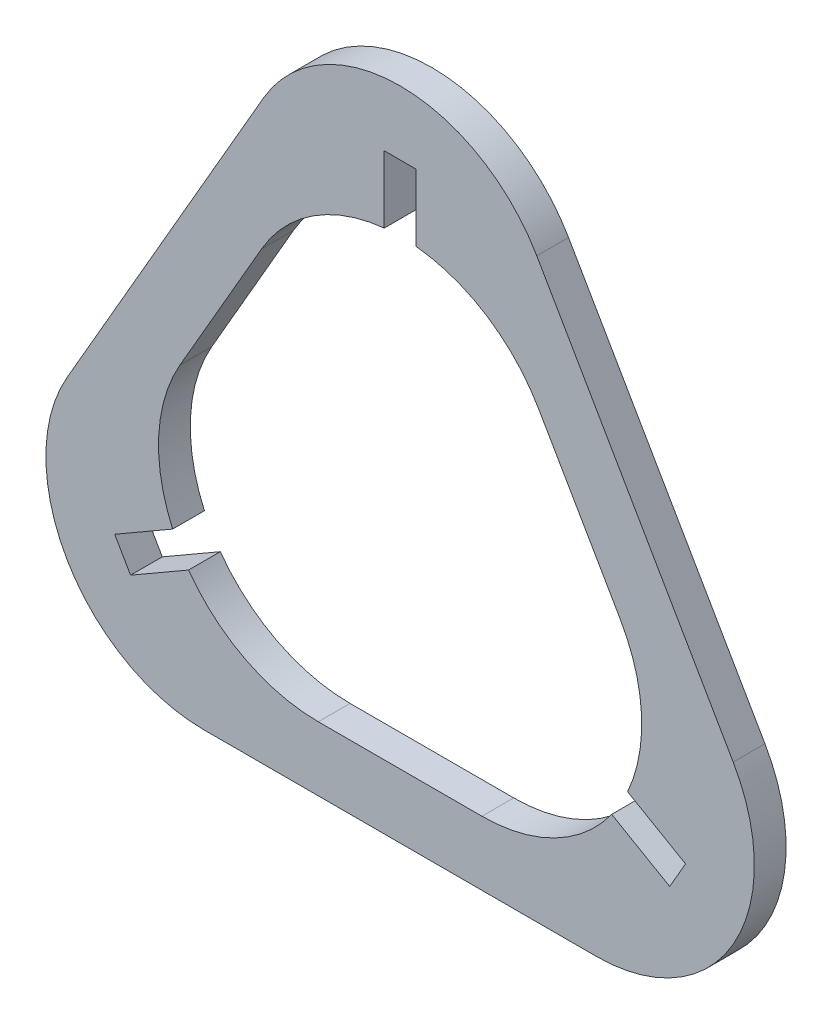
ISO-10303-21;
HEADER;
FILE_DESCRIPTION(('STEP AP214'),'2;1');
FILE_NAME('part.step','',(''),(''),'','','');
FILE_SCHEMA(('AUTOMOTIVE_DESIGN { 1 0 10303 214 1 1 1 1 }'));
ENDSEC;
DATA;
#1=APPLICATION_CONTEXT('core data for automotive mechanical design processes');
#2=APPLICATION_PROTOCOL_DEFINITION('international standard','automotive_design',2000,#1);
#3=PRODUCT_CONTEXT('',#1,'mechanical');
#4=PRODUCT('Part','Part','',(#3));
#5=PRODUCT_RELATED_PRODUCT_CATEGORY('part','',(#4));
#6=PRODUCT_DEFINITION_FORMATION('','',#4);
#7=PRODUCT_DEFINITION_CONTEXT('part definition',#1,'design');
#8=PRODUCT_DEFINITION('design','',#6,#7);
#9=PRODUCT_DEFINITION_SHAPE('','',#8);
#10=(LENGTH_UNIT() NAMED_UNIT(*) SI_UNIT(.MILLI.,.METRE.));
#11=(NAMED_UNIT(*) PLANE_ANGLE_UNIT() SI_UNIT($,.RADIAN.));
#12=(NAMED_UNIT(*) SI_UNIT($,.STERADIAN.) SOLID_ANGLE_UNIT());
#13=UNCERTAINTY_MEASURE_WITH_UNIT(LENGTH_MEASURE(1.E-05),#10,'distance_accuracy_value','');
#14=(GEOMETRIC_REPRESENTATION_CONTEXT(3) GLOBAL_UNCERTAINTY_ASSIGNED_CONTEXT((#13)) GLOBAL_UNIT_ASSIGNED_CONTEXT((#10,
#11,#12)) REPRESENTATION_CONTEXT('',''));
#15=CARTESIAN_POINT('',(0.,0.,0.));
#16=DIRECTION('',(0.,0.,1.));
#17=DIRECTION('',(1.,0.,0.));
#18=AXIS2_PLACEMENT_3D('',#15,#16,#17);
#19=CARTESIAN_POINT('',(10.3034488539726,-5.94869896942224,0.));
#20=DIRECTION('',(0.,0.,1.));
#21=DIRECTION('',(1.,0.,0.));
#22=AXIS2_PLACEMENT_3D('',#19,#20,#21);
#23=CYLINDRICAL_SURFACE('',#22,20.125);
#24=DIRECTION('',(0.,0.,1.));
#25=VECTOR('',#24,1.);
#26=CARTESIAN_POINT('',(28.6459319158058,-14.2293354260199,0.));
#27=LINE('',#26,#25);
#28=CARTESIAN_POINT('',(28.6459319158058,-14.2293354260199,0.));
#29=VERTEX_POINT('',#28);
#30=CARTESIAN_POINT('',(28.6459319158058,-14.2293354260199,4.));
#31=VERTEX_POINT('',#30);
#32=EDGE_CURVE('E227',#29,#31,#27,.T.);
#33=ORIENTED_EDGE('',*,*,#32,.T.);
#34=CARTESIAN_POINT('',(10.3034488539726,-5.94869896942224,4.));
#35=DIRECTION('',(0.,0.,1.));
#36=DIRECTION('',(1.,0.,0.));
#37=AXIS2_PLACEMENT_3D('',#34,#35,#36);
#38=CIRCLE('',#37,20.125);
#39=CARTESIAN_POINT('',(27.7322101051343,4.11380103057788,4.));
#40=VERTEX_POINT('',#39);
#41=EDGE_CURVE('E279',#40,#31,#38,.F.);
#42=ORIENTED_EDGE('',*,*,#41,.F.);
#43=DIRECTION('',(0.,0.,1.));
#44=VECTOR('',#43,1.);
#45=CARTESIAN_POINT('',(27.7322101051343,4.113801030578,0.));
#46=LINE('',#45,#44);
#47=CARTESIAN_POINT('',(27.7322101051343,4.113801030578,0.));
#48=VERTEX_POINT('',#47);
#49=EDGE_CURVE('E297',#48,#40,#46,.T.);
#50=ORIENTED_EDGE('',*,*,#49,.F.);
#51=CARTESIAN_POINT('',(10.3034488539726,-5.94869896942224,0.));
#52=DIRECTION('',(0.,0.,-1.));
#53=DIRECTION('',(-1.,0.,0.));
#54=AXIS2_PLACEMENT_3D('',#51,#52,#53);
#55=CIRCLE('',#54,20.125);
#56=EDGE_CURVE('E334',#48,#29,#55,.T.);
#57=ORIENTED_EDGE('',*,*,#56,.T.);
#58=EDGE_LOOP('',(#33,#42,#50,#57));
#59=FACE_BOUND('',#58,.T.);
#60=ADVANCED_FACE('F37',(#59),#23,.F.);
#61=CARTESIAN_POINT('',(-10.3034488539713,-5.94869896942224,0.));
#62=DIRECTION('',(0.,0.,1.));
#63=DIRECTION('',(1.,0.,0.));
#64=AXIS2_PLACEMENT_3D('',#61,#62,#63);
#65=CYLINDRICAL_SURFACE('',#64,20.125);
#66=CARTESIAN_POINT('',(-10.3034488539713,-5.94869896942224,0.));
#67=DIRECTION('',(0.,0.,-1.));
#68=DIRECTION('',(-1.,0.,0.));
#69=AXIS2_PLACEMENT_3D('',#66,#67,#68);
#70=CIRCLE('',#69,20.125);
#71=CARTESIAN_POINT('',(-26.6459319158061,-17.6934370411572,0.));
#72=VERTEX_POINT('',#71);
#73=CARTESIAN_POINT('',(-10.303448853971,-26.0736989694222,0.));
#74=VERTEX_POINT('',#73);
#75=EDGE_CURVE('E345',#72,#74,#70,.F.);
#76=ORIENTED_EDGE('',*,*,#75,.F.);
#77=DIRECTION('',(0.,0.,1.));
#78=VECTOR('',#77,1.);
#79=CARTESIAN_POINT('',(-26.6459319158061,-17.6934370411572,0.));
#80=LINE('',#79,#78);
#81=CARTESIAN_POINT('',(-26.6459319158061,-17.6934370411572,4.));
#82=VERTEX_POINT('',#81);
#83=EDGE_CURVE('E253',#72,#82,#80,.T.);
#84=ORIENTED_EDGE('',*,*,#83,.T.);
#85=CARTESIAN_POINT('',(-10.3034488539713,-5.94869896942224,4.));
#86=DIRECTION('',(0.,0.,1.));
#87=DIRECTION('',(1.,0.,0.));
#88=AXIS2_PLACEMENT_3D('',#85,#86,#87);
#89=CIRCLE('',#88,20.125);
#90=CARTESIAN_POINT('',(-10.3034488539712,-26.0736989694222,4.));
#91=VERTEX_POINT('',#90);
#92=EDGE_CURVE('E291',#82,#91,#89,.T.);
#93=ORIENTED_EDGE('',*,*,#92,.T.);
#94=DIRECTION('',(0.,0.,1.));
#95=VECTOR('',#94,1.);
#96=CARTESIAN_POINT('',(-10.303448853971,-26.0736989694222,0.));
#97=LINE('',#96,#95);
#98=EDGE_CURVE('E285',#74,#91,#97,.T.);
#99=ORIENTED_EDGE('',*,*,#98,.F.);
#100=EDGE_LOOP('',(#76,#84,#93,#99));
#101=FACE_BOUND('',#100,.T.);
#102=ADVANCED_FACE('F431',(#101),#65,.F.);
#103=CARTESIAN_POINT('',(6.39169330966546E-13,11.8973979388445,0.));
#104=DIRECTION('',(0.,0.,1.));
#105=DIRECTION('',(1.,0.,0.));
#106=AXIS2_PLACEMENT_3D('',#103,#104,#105);
#107=CYLINDRICAL_SURFACE('',#106,20.125);
#108=CARTESIAN_POINT('',(6.39169330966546E-13,11.8973979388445,0.));
#109=DIRECTION('',(0.,0.,-1.));
#110=DIRECTION('',(-1.,0.,0.));
#111=AXIS2_PLACEMENT_3D('',#108,#109,#110);
#112=CIRCLE('',#111,20.125);
#113=CARTESIAN_POINT('',(-2.,31.9227724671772,0.));
#114=VERTEX_POINT('',#113);
#115=CARTESIAN_POINT('',(-17.4287612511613,21.9598979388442,0.));
#116=VERTEX_POINT('',#115);
#117=EDGE_CURVE('E349',#114,#116,#112,.F.);
#118=ORIENTED_EDGE('',*,*,#117,.F.);
#119=DIRECTION('',(0.,0.,1.));
#120=VECTOR('',#119,1.);
#121=CARTESIAN_POINT('',(-2.,31.9227724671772,0.));
#122=LINE('',#121,#120);
#123=CARTESIAN_POINT('',(-2.,31.9227724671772,4.));
#124=VERTEX_POINT('',#123);
#125=EDGE_CURVE('E233',#114,#124,#122,.T.);
#126=ORIENTED_EDGE('',*,*,#125,.T.);
#127=CARTESIAN_POINT('',(6.39169330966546E-13,11.8973979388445,4.));
#128=DIRECTION('',(0.,0.,1.));
#129=DIRECTION('',(1.,0.,0.));
#130=AXIS2_PLACEMENT_3D('',#127,#128,#129);
#131=CIRCLE('',#130,20.125);
#132=CARTESIAN_POINT('',(-17.4287612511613,21.9598979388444,4.));
#133=VERTEX_POINT('',#132);
#134=EDGE_CURVE('E333',#124,#133,#131,.T.);
#135=ORIENTED_EDGE('',*,*,#134,.T.);
#136=DIRECTION('',(0.,0.,1.));
#137=VECTOR('',#136,1.);
#138=CARTESIAN_POINT('',(-17.4287612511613,21.9598979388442,0.));
#139=LINE('',#138,#137);
#140=EDGE_CURVE('E294',#116,#133,#139,.T.);
#141=ORIENTED_EDGE('',*,*,#140,.F.);
#142=EDGE_LOOP('',(#118,#126,#135,#141));
#143=FACE_BOUND('',#142,.T.);
#144=ADVANCED_FACE('F390',(#143),#107,.F.);
#145=CARTESIAN_POINT('',(0.,0.,0.));
#146=DIRECTION('',(0.,0.,1.));
#147=DIRECTION('',(1.,0.,0.));
#148=AXIS2_PLACEMENT_3D('',#145,#146,#147);
#149=PLANE('',#148);
#150=DIRECTION('',(-0.5,0.866025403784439,0.));
#151=VECTOR('',#150,1.);
#152=CARTESIAN_POINT('',(41.9494604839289,-4.34453230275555,0.));
#153=LINE('',#152,#151);
#154=CARTESIAN_POINT('',(41.9494604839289,-4.34453230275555,0.));
#155=VERTEX_POINT('',#154);
#156=CARTESIAN_POINT('',(17.2122549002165,38.5015646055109,0.));
#157=VERTEX_POINT('',#156);
#158=EDGE_CURVE('E316',#155,#157,#153,.T.);
#159=ORIENTED_EDGE('',*,*,#158,.F.);
#160=CARTESIAN_POINT('',(24.7372055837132,-14.2820323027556,0.));
#161=DIRECTION('',(0.,0.,-1.));
#162=DIRECTION('',(-1.,0.,0.));
#163=AXIS2_PLACEMENT_3D('',#160,#161,#162);
#164=CIRCLE('',#163,19.875);
#165=CARTESIAN_POINT('',(24.7372055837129,-34.1570323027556,0.));
#166=VERTEX_POINT('',#165);
#167=EDGE_CURVE('E329',#155,#166,#164,.T.);
#168=ORIENTED_EDGE('',*,*,#167,.T.);
#169=DIRECTION('',(1.,0.,0.));
#170=VECTOR('',#169,1.);
#171=CARTESIAN_POINT('',(24.7372055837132,-34.1570323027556,0.));
#172=LINE('',#171,#170);
#173=CARTESIAN_POINT('',(-24.7372055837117,-34.1570323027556,0.));
#174=VERTEX_POINT('',#173);
#175=EDGE_CURVE('E301',#174,#166,#172,.T.);
#176=ORIENTED_EDGE('',*,*,#175,.F.);
#177=CARTESIAN_POINT('',(-24.737205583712,-14.2820323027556,0.));
#178=DIRECTION('',(0.,0.,-1.));
#179=DIRECTION('',(-1.,0.,0.));
#180=AXIS2_PLACEMENT_3D('',#177,#178,#179);
#181=CIRCLE('',#180,19.875);
#182=CARTESIAN_POINT('',(-41.9494604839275,-4.34453230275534,0.));
#183=VERTEX_POINT('',#182);
#184=EDGE_CURVE('E305',#183,#174,#181,.F.);
#185=ORIENTED_EDGE('',*,*,#184,.F.);
#186=DIRECTION('',(-0.5,-0.866025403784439,0.));
#187=VECTOR('',#186,1.);
#188=CARTESIAN_POINT('',(-29.5808576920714,17.0785161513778,0.));
#189=LINE('',#188,#187);
#190=CARTESIAN_POINT('',(-17.2122549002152,38.5015646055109,0.));
#191=VERTEX_POINT('',#190);
#192=EDGE_CURVE('E309',#191,#183,#189,.T.);
#193=ORIENTED_EDGE('',*,*,#192,.F.);
#194=CARTESIAN_POINT('',(6.29704621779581E-13,28.5640646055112,0.));
#195=DIRECTION('',(0.,0.,-1.));
#196=DIRECTION('',(-1.,0.,0.));
#197=AXIS2_PLACEMENT_3D('',#194,#195,#196);
#198=CIRCLE('',#197,19.875);
#199=EDGE_CURVE('E313',#157,#191,#198,.F.);
#200=ORIENTED_EDGE('',*,*,#199,.F.);
#201=EDGE_LOOP('',(#159,#168,#176,#185,#193,#200));
#202=FACE_BOUND('',#201,.T.);
#203=DIRECTION('',(0.500000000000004,0.866025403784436,0.));
#204=VECTOR('',#203,1.);
#205=CARTESIAN_POINT('',(34.949088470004,-20.1778656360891,0.));
#206=LINE('',#205,#204);
#207=CARTESIAN_POINT('',(33.949088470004,-21.909916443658,0.));
#208=VERTEX_POINT('',#207);
#209=CARTESIAN_POINT('',(35.949088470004,-18.4458148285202,0.));
#210=VERTEX_POINT('',#209);
#211=EDGE_CURVE('E211',#208,#210,#206,.T.);
#212=ORIENTED_EDGE('',*,*,#211,.T.);
#213=DIRECTION('',(-0.866025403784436,0.500000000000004,0.));
#214=VECTOR('',#213,1.);
#215=CARTESIAN_POINT('',(1.00000000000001,1.73205080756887,0.));
#216=LINE('',#215,#214);
#217=EDGE_CURVE('E230',#210,#29,#216,.T.);
#218=ORIENTED_EDGE('',*,*,#217,.T.);
#219=ORIENTED_EDGE('',*,*,#56,.F.);
#220=DIRECTION('',(-0.5,0.866025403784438,0.));
#221=VECTOR('',#220,1.);
#222=CARTESIAN_POINT('',(27.7322101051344,4.11380103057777,0.));
#223=LINE('',#222,#221);
#224=CARTESIAN_POINT('',(17.4287612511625,21.9598979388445,0.));
#225=VERTEX_POINT('',#224);
#226=EDGE_CURVE('E341',#48,#225,#223,.T.);
#227=ORIENTED_EDGE('',*,*,#226,.T.);
#228=CARTESIAN_POINT('',(2.,31.9227724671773,0.));
#229=VERTEX_POINT('',#228);
#230=EDGE_CURVE('E41',#225,#229,#112,.F.);
#231=ORIENTED_EDGE('',*,*,#230,.T.);
#232=DIRECTION('',(0.,1.,0.));
#233=VECTOR('',#232,1.);
#234=CARTESIAN_POINT('',(2.,0.,0.));
#235=LINE('',#234,#233);
#236=CARTESIAN_POINT('',(2.,40.3557312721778,0.));
#237=VERTEX_POINT('',#236);
#238=EDGE_CURVE('E372',#229,#237,#235,.T.);
#239=ORIENTED_EDGE('',*,*,#238,.T.);
#240=DIRECTION('',(-1.,0.,0.));
#241=VECTOR('',#240,1.);
#242=CARTESIAN_POINT('',(0.,40.3557312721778,0.));
#243=LINE('',#242,#241);
#244=CARTESIAN_POINT('',(-2.,40.3557312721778,0.));
#245=VERTEX_POINT('',#244);
#246=EDGE_CURVE('E332',#237,#245,#243,.T.);
#247=ORIENTED_EDGE('',*,*,#246,.T.);
#248=DIRECTION('',(0.,-1.,0.));
#249=VECTOR('',#248,1.);
#250=CARTESIAN_POINT('',(-2.,0.,0.));
#251=LINE('',#250,#249);
#252=EDGE_CURVE('E365',#245,#114,#251,.T.);
#253=ORIENTED_EDGE('',*,*,#252,.T.);
#254=ORIENTED_EDGE('',*,*,#117,.T.);
#255=DIRECTION('',(-0.5,-0.866025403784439,0.));
#256=VECTOR('',#255,1.);
#257=CARTESIAN_POINT('',(-22.5804856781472,13.0368494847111,0.));
#258=LINE('',#257,#256);
#259=CARTESIAN_POINT('',(-27.732210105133,4.11380103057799,0.));
#260=VERTEX_POINT('',#259);
#261=EDGE_CURVE('E346',#116,#260,#258,.T.);
#262=ORIENTED_EDGE('',*,*,#261,.T.);
#263=CARTESIAN_POINT('',(-28.6459319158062,-14.2293354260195,0.));
#264=VERTEX_POINT('',#263);
#265=EDGE_CURVE('E342',#260,#264,#70,.F.);
#266=ORIENTED_EDGE('',*,*,#265,.T.);
#267=DIRECTION('',(-0.866025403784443,-0.499999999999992,0.));
#268=VECTOR('',#267,1.);
#269=CARTESIAN_POINT('',(-0.999999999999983,1.73205080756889,0.));
#270=LINE('',#269,#268);
#271=CARTESIAN_POINT('',(-35.9490884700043,-18.4458148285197,0.));
#272=VERTEX_POINT('',#271);
#273=EDGE_CURVE('E240',#264,#272,#270,.T.);
#274=ORIENTED_EDGE('',*,*,#273,.T.);
#275=DIRECTION('',(0.499999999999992,-0.866025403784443,0.));
#276=VECTOR('',#275,1.);
#277=CARTESIAN_POINT('',(-34.9490884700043,-20.1778656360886,0.));
#278=LINE('',#277,#276);
#279=CARTESIAN_POINT('',(-33.9490884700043,-21.9099164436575,0.));
#280=VERTEX_POINT('',#279);
#281=EDGE_CURVE('E248',#272,#280,#278,.T.);
#282=ORIENTED_EDGE('',*,*,#281,.T.);
#283=DIRECTION('',(0.866025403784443,0.499999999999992,0.));
#284=VECTOR('',#283,1.);
#285=CARTESIAN_POINT('',(0.999999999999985,-1.73205080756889,0.));
#286=LINE('',#285,#284);
#287=EDGE_CURVE('E256',#280,#72,#286,.T.);
#288=ORIENTED_EDGE('',*,*,#287,.T.);
#289=ORIENTED_EDGE('',*,*,#75,.T.);
#290=DIRECTION('',(1.,0.,0.));
#291=VECTOR('',#290,1.);
#292=CARTESIAN_POINT('',(10.3034488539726,-26.0736989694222,0.));
#293=LINE('',#292,#291);
#294=CARTESIAN_POINT('',(10.3034488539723,-26.0736989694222,0.));
#295=VERTEX_POINT('',#294);
#296=EDGE_CURVE('E338',#74,#295,#293,.T.);
#297=ORIENTED_EDGE('',*,*,#296,.T.);
#298=CARTESIAN_POINT('',(26.6459319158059,-17.6934370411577,0.));
#299=VERTEX_POINT('',#298);
#300=EDGE_CURVE('E337',#299,#295,#55,.T.);
#301=ORIENTED_EDGE('',*,*,#300,.F.);
#302=DIRECTION('',(0.866025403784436,-0.500000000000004,0.));
#303=VECTOR('',#302,1.);
#304=CARTESIAN_POINT('',(-1.00000000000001,-1.73205080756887,0.));
#305=LINE('',#304,#303);
#306=EDGE_CURVE('E213',#299,#208,#305,.T.);
#307=ORIENTED_EDGE('',*,*,#306,.T.);
#308=EDGE_LOOP('',(#212,#218,#219,#227,#231,#239,#247,#253,#254,#262,#266,#274,#282,#288,#289,
#297,#301,#307));
#309=FACE_BOUND('',#308,.T.);
#310=ADVANCED_FACE('F39',(#202,#309),#149,.F.);
#311=DIRECTION('',(0.,0.,1.));
#312=VECTOR('',#311,1.);
#313=CARTESIAN_POINT('',(26.6459319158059,-17.6934370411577,0.));
#314=LINE('',#313,#312);
#315=CARTESIAN_POINT('',(26.6459319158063,-17.6934370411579,4.));
#316=VERTEX_POINT('',#315);
#317=EDGE_CURVE('E62',#316,#299,#314,.F.);
#318=ORIENTED_EDGE('',*,*,#317,.T.);
#319=ORIENTED_EDGE('',*,*,#300,.T.);
#320=DIRECTION('',(0.,0.,1.));
#321=VECTOR('',#320,1.);
#322=CARTESIAN_POINT('',(10.3034488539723,-26.0736989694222,0.));
#323=LINE('',#322,#321);
#324=CARTESIAN_POINT('',(10.3034488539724,-26.0736989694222,4.));
#325=VERTEX_POINT('',#324);
#326=EDGE_CURVE('E286',#295,#325,#323,.T.);
#327=ORIENTED_EDGE('',*,*,#326,.T.);
#328=EDGE_CURVE('E281',#316,#325,#38,.F.);
#329=ORIENTED_EDGE('',*,*,#328,.F.);
#330=EDGE_LOOP('',(#318,#319,#327,#329));
#331=FACE_BOUND('',#330,.T.);
#332=ADVANCED_FACE('F434',(#331),#23,.F.);
#333=CARTESIAN_POINT('',(10.3034488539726,-26.0736989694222,0.));
#334=DIRECTION('',(0.,-1.,0.));
#335=DIRECTION('',(0.,0.,-1.));
#336=AXIS2_PLACEMENT_3D('',#333,#334,#335);
#337=PLANE('',#336);
#338=DIRECTION('',(1.,0.,0.));
#339=VECTOR('',#338,1.);
#340=CARTESIAN_POINT('',(10.3034488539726,-26.0736989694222,4.));
#341=LINE('',#340,#339);
#342=EDGE_CURVE('E282',#91,#325,#341,.T.);
#343=ORIENTED_EDGE('',*,*,#342,.T.);
#344=ORIENTED_EDGE('',*,*,#326,.F.);
#345=ORIENTED_EDGE('',*,*,#296,.F.);
#346=ORIENTED_EDGE('',*,*,#98,.T.);
#347=EDGE_LOOP('',(#343,#344,#345,#346));
#348=FACE_BOUND('',#347,.T.);
#349=ADVANCED_FACE('F443',(#348),#337,.F.);
#350=CARTESIAN_POINT('',(-27.7322101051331,4.11380103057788,4.));
#351=VERTEX_POINT('',#350);
#352=CARTESIAN_POINT('',(-28.6459319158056,-14.2293354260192,4.));
#353=VERTEX_POINT('',#352);
#354=EDGE_CURVE('E287',#351,#353,#89,.T.);
#355=ORIENTED_EDGE('',*,*,#354,.T.);
#356=DIRECTION('',(0.,0.,1.));
#357=VECTOR('',#356,1.);
#358=CARTESIAN_POINT('',(-28.6459319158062,-14.2293354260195,0.));
#359=LINE('',#358,#357);
#360=EDGE_CURVE('E54',#353,#264,#359,.F.);
#361=ORIENTED_EDGE('',*,*,#360,.T.);
#362=ORIENTED_EDGE('',*,*,#265,.F.);
#363=DIRECTION('',(0.,0.,1.));
#364=VECTOR('',#363,1.);
#365=CARTESIAN_POINT('',(-27.732210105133,4.11380103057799,0.));
#366=LINE('',#365,#364);
#367=EDGE_CURVE('E290',#260,#351,#366,.T.);
#368=ORIENTED_EDGE('',*,*,#367,.T.);
#369=EDGE_LOOP('',(#355,#361,#362,#368));
#370=FACE_BOUND('',#369,.T.);
#371=ADVANCED_FACE('F399',(#370),#65,.F.);
#372=CARTESIAN_POINT('',(-22.5804856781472,13.0368494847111,0.));
#373=DIRECTION('',(-0.866025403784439,0.5,0.));
#374=DIRECTION('',(-0.5,-0.866025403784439,0.));
#375=AXIS2_PLACEMENT_3D('',#372,#373,#374);
#376=PLANE('',#375);
#377=DIRECTION('',(-0.5,-0.866025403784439,0.));
#378=VECTOR('',#377,1.);
#379=CARTESIAN_POINT('',(-22.5804856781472,13.0368494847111,4.));
#380=LINE('',#379,#378);
#381=EDGE_CURVE('E292',#133,#351,#380,.T.);
#382=ORIENTED_EDGE('',*,*,#381,.T.);
#383=ORIENTED_EDGE('',*,*,#367,.F.);
#384=ORIENTED_EDGE('',*,*,#261,.F.);
#385=ORIENTED_EDGE('',*,*,#140,.T.);
#386=EDGE_LOOP('',(#382,#383,#384,#385));
#387=FACE_BOUND('',#386,.T.);
#388=ADVANCED_FACE('F395',(#387),#376,.F.);
#389=CARTESIAN_POINT('',(17.4287612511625,21.9598979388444,4.));
#390=VERTEX_POINT('',#389);
#391=CARTESIAN_POINT('',(2.,31.9227724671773,4.));
#392=VERTEX_POINT('',#391);
#393=EDGE_CURVE('E358',#390,#392,#131,.T.);
#394=ORIENTED_EDGE('',*,*,#393,.T.);
#395=DIRECTION('',(0.,0.,1.));
#396=VECTOR('',#395,1.);
#397=CARTESIAN_POINT('',(2.,31.9227724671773,0.));
#398=LINE('',#397,#396);
#399=EDGE_CURVE('E355',#392,#229,#398,.F.);
#400=ORIENTED_EDGE('',*,*,#399,.T.);
#401=ORIENTED_EDGE('',*,*,#230,.F.);
#402=DIRECTION('',(0.,0.,1.));
#403=VECTOR('',#402,1.);
#404=CARTESIAN_POINT('',(17.4287612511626,21.9598979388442,0.));
#405=LINE('',#404,#403);
#406=EDGE_CURVE('E298',#225,#390,#405,.T.);
#407=ORIENTED_EDGE('',*,*,#406,.T.);
#408=EDGE_LOOP('',(#394,#400,#401,#407));
#409=FACE_BOUND('',#408,.T.);
#410=ADVANCED_FACE('F406',(#409),#107,.F.);
#411=CARTESIAN_POINT('',(27.7322101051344,4.11380103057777,0.));
#412=DIRECTION('',(0.866025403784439,0.5,0.));
#413=DIRECTION('',(-0.5,0.866025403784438,0.));
#414=AXIS2_PLACEMENT_3D('',#411,#412,#413);
#415=PLANE('',#414);
#416=DIRECTION('',(-0.5,0.866025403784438,0.));
#417=VECTOR('',#416,1.);
#418=CARTESIAN_POINT('',(27.7322101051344,4.11380103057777,4.));
#419=LINE('',#418,#417);
#420=EDGE_CURVE('E295',#40,#390,#419,.T.);
#421=ORIENTED_EDGE('',*,*,#420,.T.);
#422=ORIENTED_EDGE('',*,*,#406,.F.);
#423=ORIENTED_EDGE('',*,*,#226,.F.);
#424=ORIENTED_EDGE('',*,*,#49,.T.);
#425=EDGE_LOOP('',(#421,#422,#423,#424));
#426=FACE_BOUND('',#425,.T.);
#427=ADVANCED_FACE('F408',(#426),#415,.F.);
#428=CARTESIAN_POINT('',(41.9494604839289,-4.34453230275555,0.));
#429=DIRECTION('',(0.866025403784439,0.5,0.));
#430=DIRECTION('',(-0.5,0.866025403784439,0.));
#431=AXIS2_PLACEMENT_3D('',#428,#429,#430);
#432=PLANE('',#431);
#433=DIRECTION('',(0.,0.,1.));
#434=VECTOR('',#433,1.);
#435=CARTESIAN_POINT('',(41.9494604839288,-4.34453230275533,0.));
#436=LINE('',#435,#434);
#437=CARTESIAN_POINT('',(41.9494604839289,-4.34453230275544,4.));
#438=VERTEX_POINT('',#437);
#439=EDGE_CURVE('E261',#155,#438,#436,.T.);
#440=ORIENTED_EDGE('',*,*,#439,.F.);
#441=ORIENTED_EDGE('',*,*,#158,.T.);
#442=DIRECTION('',(0.,0.,1.));
#443=VECTOR('',#442,1.);
#444=CARTESIAN_POINT('',(17.2122549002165,38.5015646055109,0.));
#445=LINE('',#444,#443);
#446=CARTESIAN_POINT('',(17.2122549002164,38.501564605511,4.));
#447=VERTEX_POINT('',#446);
#448=EDGE_CURVE('E314',#157,#447,#445,.T.);
#449=ORIENTED_EDGE('',*,*,#448,.T.);
#450=DIRECTION('',(-0.5,0.866025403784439,0.));
#451=VECTOR('',#450,1.);
#452=CARTESIAN_POINT('',(41.9494604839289,-4.34453230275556,4.));
#453=LINE('',#452,#451);
#454=EDGE_CURVE('E276',#438,#447,#453,.T.);
#455=ORIENTED_EDGE('',*,*,#454,.F.);
#456=EDGE_LOOP('',(#440,#441,#449,#455));
#457=FACE_BOUND('',#456,.T.);
#458=ADVANCED_FACE('F499',(#457),#432,.T.);
#459=CARTESIAN_POINT('',(6.29704621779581E-13,28.5640646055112,0.));
#460=DIRECTION('',(0.,0.,1.));
#461=DIRECTION('',(1.,0.,0.));
#462=AXIS2_PLACEMENT_3D('',#459,#460,#461);
#463=CYLINDRICAL_SURFACE('',#462,19.875);
#464=ORIENTED_EDGE('',*,*,#448,.F.);
#465=ORIENTED_EDGE('',*,*,#199,.T.);
#466=DIRECTION('',(0.,0.,1.));
#467=VECTOR('',#466,1.);
#468=CARTESIAN_POINT('',(-17.2122549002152,38.5015646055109,0.));
#469=LINE('',#468,#467);
#470=CARTESIAN_POINT('',(-17.2122549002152,38.501564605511,4.));
#471=VERTEX_POINT('',#470);
#472=EDGE_CURVE('E310',#191,#471,#469,.T.);
#473=ORIENTED_EDGE('',*,*,#472,.T.);
#474=CARTESIAN_POINT('',(6.29704621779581E-13,28.5640646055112,4.));
#475=DIRECTION('',(0.,0.,1.));
#476=DIRECTION('',(1.,0.,0.));
#477=AXIS2_PLACEMENT_3D('',#474,#475,#476);
#478=CIRCLE('',#477,19.875);
#479=EDGE_CURVE('E273',#447,#471,#478,.T.);
#480=ORIENTED_EDGE('',*,*,#479,.F.);
#481=EDGE_LOOP('',(#464,#465,#473,#480));
#482=FACE_BOUND('',#481,.T.);
#483=ADVANCED_FACE('F495',(#482),#463,.T.);
#484=CARTESIAN_POINT('',(-29.5808576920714,17.0785161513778,0.));
#485=DIRECTION('',(-0.866025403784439,0.5,0.));
#486=DIRECTION('',(-0.5,-0.866025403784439,0.));
#487=AXIS2_PLACEMENT_3D('',#484,#485,#486);
#488=PLANE('',#487);
#489=ORIENTED_EDGE('',*,*,#472,.F.);
#490=ORIENTED_EDGE('',*,*,#192,.T.);
#491=DIRECTION('',(0.,0.,1.));
#492=VECTOR('',#491,1.);
#493=CARTESIAN_POINT('',(-41.9494604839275,-4.34453230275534,0.));
#494=LINE('',#493,#492);
#495=CARTESIAN_POINT('',(-41.9494604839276,-4.34453230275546,4.));
#496=VERTEX_POINT('',#495);
#497=EDGE_CURVE('E306',#183,#496,#494,.T.);
#498=ORIENTED_EDGE('',*,*,#497,.T.);
#499=DIRECTION('',(-0.5,-0.866025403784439,0.));
#500=VECTOR('',#499,1.);
#501=CARTESIAN_POINT('',(-17.2122549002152,38.501564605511,4.));
#502=LINE('',#501,#500);
#503=EDGE_CURVE('E270',#471,#496,#502,.T.);
#504=ORIENTED_EDGE('',*,*,#503,.F.);
#505=EDGE_LOOP('',(#489,#490,#498,#504));
#506=FACE_BOUND('',#505,.T.);
#507=ADVANCED_FACE('F491',(#506),#488,.T.);
#508=CARTESIAN_POINT('',(-24.737205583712,-14.2820323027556,0.));
#509=DIRECTION('',(0.,0.,1.));
#510=DIRECTION('',(1.,0.,0.));
#511=AXIS2_PLACEMENT_3D('',#508,#509,#510);
#512=CYLINDRICAL_SURFACE('',#511,19.875);
#513=ORIENTED_EDGE('',*,*,#497,.F.);
#514=ORIENTED_EDGE('',*,*,#184,.T.);
#515=DIRECTION('',(0.,0.,1.));
#516=VECTOR('',#515,1.);
#517=CARTESIAN_POINT('',(-24.7372055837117,-34.1570323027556,0.));
#518=LINE('',#517,#516);
#519=CARTESIAN_POINT('',(-24.7372055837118,-34.1570323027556,4.));
#520=VERTEX_POINT('',#519);
#521=EDGE_CURVE('E302',#174,#520,#518,.T.);
#522=ORIENTED_EDGE('',*,*,#521,.T.);
#523=CARTESIAN_POINT('',(-24.737205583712,-14.2820323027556,4.));
#524=DIRECTION('',(0.,0.,1.));
#525=DIRECTION('',(1.,0.,0.));
#526=AXIS2_PLACEMENT_3D('',#523,#524,#525);
#527=CIRCLE('',#526,19.875);
#528=EDGE_CURVE('E267',#496,#520,#527,.T.);
#529=ORIENTED_EDGE('',*,*,#528,.F.);
#530=EDGE_LOOP('',(#513,#514,#522,#529));
#531=FACE_BOUND('',#530,.T.);
#532=ADVANCED_FACE('F487',(#531),#512,.T.);
#533=CARTESIAN_POINT('',(24.7372055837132,-34.1570323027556,0.));
#534=DIRECTION('',(0.,-1.,0.));
#535=DIRECTION('',(1.,0.,0.));
#536=AXIS2_PLACEMENT_3D('',#533,#534,#535);
#537=PLANE('',#536);
#538=ORIENTED_EDGE('',*,*,#521,.F.);
#539=ORIENTED_EDGE('',*,*,#175,.T.);
#540=DIRECTION('',(0.,0.,1.));
#541=VECTOR('',#540,1.);
#542=CARTESIAN_POINT('',(24.7372055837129,-34.1570323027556,0.));
#543=LINE('',#542,#541);
#544=CARTESIAN_POINT('',(24.7372055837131,-34.1570323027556,4.));
#545=VERTEX_POINT('',#544);
#546=EDGE_CURVE('E262',#166,#545,#543,.T.);
#547=ORIENTED_EDGE('',*,*,#546,.T.);
#548=DIRECTION('',(1.,0.,0.));
#549=VECTOR('',#548,1.);
#550=CARTESIAN_POINT('',(0.,-34.1570323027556,4.));
#551=LINE('',#550,#549);
#552=EDGE_CURVE('E263',#520,#545,#551,.T.);
#553=ORIENTED_EDGE('',*,*,#552,.F.);
#554=EDGE_LOOP('',(#538,#539,#547,#553));
#555=FACE_BOUND('',#554,.T.);
#556=ADVANCED_FACE('F483',(#555),#537,.T.);
#557=CARTESIAN_POINT('',(24.7372055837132,-14.2820323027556,0.));
#558=DIRECTION('',(0.,0.,1.));
#559=DIRECTION('',(1.,0.,0.));
#560=AXIS2_PLACEMENT_3D('',#557,#558,#559);
#561=CYLINDRICAL_SURFACE('',#560,19.875);
#562=CARTESIAN_POINT('',(24.7372055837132,-14.2820323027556,4.));
#563=DIRECTION('',(0.,0.,1.));
#564=DIRECTION('',(1.,0.,0.));
#565=AXIS2_PLACEMENT_3D('',#562,#563,#564);
#566=CIRCLE('',#565,19.875);
#567=EDGE_CURVE('E259',#438,#545,#566,.F.);
#568=ORIENTED_EDGE('',*,*,#567,.T.);
#569=ORIENTED_EDGE('',*,*,#546,.F.);
#570=ORIENTED_EDGE('',*,*,#167,.F.);
#571=ORIENTED_EDGE('',*,*,#439,.T.);
#572=EDGE_LOOP('',(#568,#569,#570,#571));
#573=FACE_BOUND('',#572,.T.);
#574=ADVANCED_FACE('F428',(#573),#561,.T.);
#575=CARTESIAN_POINT('',(0.,0.,4.));
#576=DIRECTION('',(0.,0.,1.));
#577=DIRECTION('',(1.,0.,0.));
#578=AXIS2_PLACEMENT_3D('',#575,#576,#577);
#579=PLANE('',#578);
#580=DIRECTION('',(-0.866025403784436,0.500000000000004,0.));
#581=VECTOR('',#580,1.);
#582=CARTESIAN_POINT('',(1.00000000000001,1.73205080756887,4.));
#583=LINE('',#582,#581);
#584=CARTESIAN_POINT('',(35.949088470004,-18.4458148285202,4.));
#585=VERTEX_POINT('',#584);
#586=EDGE_CURVE('E219',#585,#31,#583,.T.);
#587=ORIENTED_EDGE('',*,*,#586,.F.);
#588=DIRECTION('',(0.500000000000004,0.866025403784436,0.));
#589=VECTOR('',#588,1.);
#590=CARTESIAN_POINT('',(34.949088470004,-20.1778656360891,4.));
#591=LINE('',#590,#589);
#592=CARTESIAN_POINT('',(33.949088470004,-21.909916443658,4.));
#593=VERTEX_POINT('',#592);
#594=EDGE_CURVE('E208',#593,#585,#591,.T.);
#595=ORIENTED_EDGE('',*,*,#594,.F.);
#596=DIRECTION('',(0.866025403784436,-0.500000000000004,0.));
#597=VECTOR('',#596,1.);
#598=CARTESIAN_POINT('',(-1.00000000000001,-1.73205080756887,4.));
#599=LINE('',#598,#597);
#600=EDGE_CURVE('E197',#316,#593,#599,.T.);
#601=ORIENTED_EDGE('',*,*,#600,.F.);
#602=ORIENTED_EDGE('',*,*,#328,.T.);
#603=ORIENTED_EDGE('',*,*,#342,.F.);
#604=ORIENTED_EDGE('',*,*,#92,.F.);
#605=DIRECTION('',(0.866025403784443,0.499999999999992,0.));
#606=VECTOR('',#605,1.);
#607=CARTESIAN_POINT('',(0.999999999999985,-1.73205080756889,4.));
#608=LINE('',#607,#606);
#609=CARTESIAN_POINT('',(-33.9490884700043,-21.9099164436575,4.));
#610=VERTEX_POINT('',#609);
#611=EDGE_CURVE('E251',#610,#82,#608,.T.);
#612=ORIENTED_EDGE('',*,*,#611,.F.);
#613=DIRECTION('',(0.499999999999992,-0.866025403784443,0.));
#614=VECTOR('',#613,1.);
#615=CARTESIAN_POINT('',(-34.9490884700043,-20.1778656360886,4.));
#616=LINE('',#615,#614);
#617=CARTESIAN_POINT('',(-35.9490884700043,-18.4458148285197,4.));
#618=VERTEX_POINT('',#617);
#619=EDGE_CURVE('E243',#618,#610,#616,.T.);
#620=ORIENTED_EDGE('',*,*,#619,.F.);
#621=DIRECTION('',(-0.866025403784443,-0.499999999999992,0.));
#622=VECTOR('',#621,1.);
#623=CARTESIAN_POINT('',(-0.999999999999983,1.73205080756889,4.));
#624=LINE('',#623,#622);
#625=EDGE_CURVE('E235',#353,#618,#624,.T.);
#626=ORIENTED_EDGE('',*,*,#625,.F.);
#627=ORIENTED_EDGE('',*,*,#354,.F.);
#628=ORIENTED_EDGE('',*,*,#381,.F.);
#629=ORIENTED_EDGE('',*,*,#134,.F.);
#630=DIRECTION('',(0.,-1.,0.));
#631=VECTOR('',#630,1.);
#632=CARTESIAN_POINT('',(-2.,0.,4.));
#633=LINE('',#632,#631);
#634=CARTESIAN_POINT('',(-2.,40.3557312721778,4.));
#635=VERTEX_POINT('',#634);
#636=EDGE_CURVE('E379',#635,#124,#633,.T.);
#637=ORIENTED_EDGE('',*,*,#636,.F.);
#638=DIRECTION('',(-1.,0.,0.));
#639=VECTOR('',#638,1.);
#640=CARTESIAN_POINT('',(0.,40.3557312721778,4.));
#641=LINE('',#640,#639);
#642=CARTESIAN_POINT('',(2.,40.3557312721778,4.));
#643=VERTEX_POINT('',#642);
#644=EDGE_CURVE('E46',#643,#635,#641,.T.);
#645=ORIENTED_EDGE('',*,*,#644,.F.);
#646=DIRECTION('',(0.,1.,0.));
#647=VECTOR('',#646,1.);
#648=CARTESIAN_POINT('',(2.,0.,4.));
#649=LINE('',#648,#647);
#650=EDGE_CURVE('E11',#392,#643,#649,.T.);
#651=ORIENTED_EDGE('',*,*,#650,.F.);
#652=ORIENTED_EDGE('',*,*,#393,.F.);
#653=ORIENTED_EDGE('',*,*,#420,.F.);
#654=ORIENTED_EDGE('',*,*,#41,.T.);
#655=EDGE_LOOP('',(#587,#595,#601,#602,#603,#604,#612,#620,#626,#627,#628,#629,#637,#645,#651,
#652,#653,#654));
#656=FACE_BOUND('',#655,.T.);
#657=ORIENTED_EDGE('',*,*,#567,.F.);
#658=ORIENTED_EDGE('',*,*,#454,.T.);
#659=ORIENTED_EDGE('',*,*,#479,.T.);
#660=ORIENTED_EDGE('',*,*,#503,.T.);
#661=ORIENTED_EDGE('',*,*,#528,.T.);
#662=ORIENTED_EDGE('',*,*,#552,.T.);
#663=EDGE_LOOP('',(#657,#658,#659,#660,#661,#662));
#664=FACE_BOUND('',#663,.T.);
#665=ADVANCED_FACE('F216',(#656,#664),#579,.T.);
#666=CARTESIAN_POINT('',(-2.,0.,-6.));
#667=DIRECTION('',(-1.,0.,0.));
#668=DIRECTION('',(0.,-1.,0.));
#669=AXIS2_PLACEMENT_3D('',#666,#667,#668);
#670=PLANE('',#669);
#671=DIRECTION('',(0.,0.,1.));
#672=VECTOR('',#671,1.);
#673=CARTESIAN_POINT('',(-2.,40.3557312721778,-6.));
#674=LINE('',#673,#672);
#675=EDGE_CURVE('E266',#245,#635,#674,.T.);
#676=ORIENTED_EDGE('',*,*,#675,.T.);
#677=ORIENTED_EDGE('',*,*,#636,.T.);
#678=ORIENTED_EDGE('',*,*,#125,.F.);
#679=ORIENTED_EDGE('',*,*,#252,.F.);
#680=EDGE_LOOP('',(#676,#677,#678,#679));
#681=FACE_BOUND('',#680,.T.);
#682=ADVANCED_FACE('F420',(#681),#670,.F.);
#683=CARTESIAN_POINT('',(0.,40.3557312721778,-6.));
#684=DIRECTION('',(0.,1.,0.));
#685=DIRECTION('',(0.,0.,1.));
#686=AXIS2_PLACEMENT_3D('',#683,#684,#685);
#687=PLANE('',#686);
#688=DIRECTION('',(0.,0.,1.));
#689=VECTOR('',#688,1.);
#690=CARTESIAN_POINT('',(2.,40.3557312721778,-6.));
#691=LINE('',#690,#689);
#692=EDGE_CURVE('E377',#237,#643,#691,.T.);
#693=ORIENTED_EDGE('',*,*,#692,.T.);
#694=ORIENTED_EDGE('',*,*,#644,.T.);
#695=ORIENTED_EDGE('',*,*,#675,.F.);
#696=ORIENTED_EDGE('',*,*,#246,.F.);
#697=EDGE_LOOP('',(#693,#694,#695,#696));
#698=FACE_BOUND('',#697,.T.);
#699=ADVANCED_FACE('F417',(#698),#687,.F.);
#700=CARTESIAN_POINT('',(2.,0.,-6.));
#701=DIRECTION('',(1.,0.,0.));
#702=DIRECTION('',(0.,1.,0.));
#703=AXIS2_PLACEMENT_3D('',#700,#701,#702);
#704=PLANE('',#703);
#705=ORIENTED_EDGE('',*,*,#399,.F.);
#706=ORIENTED_EDGE('',*,*,#650,.T.);
#707=ORIENTED_EDGE('',*,*,#692,.F.);
#708=ORIENTED_EDGE('',*,*,#238,.F.);
#709=EDGE_LOOP('',(#705,#706,#707,#708));
#710=FACE_BOUND('',#709,.T.);
#711=ADVANCED_FACE('F415',(#710),#704,.F.);
#712=CARTESIAN_POINT('',(0.999999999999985,-1.73205080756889,-6.));
#713=DIRECTION('',(0.499999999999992,-0.866025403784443,0.));
#714=DIRECTION('',(0.866025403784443,0.499999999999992,0.));
#715=AXIS2_PLACEMENT_3D('',#712,#713,#714);
#716=PLANE('',#715);
#717=DIRECTION('',(0.,0.,1.));
#718=VECTOR('',#717,1.);
#719=CARTESIAN_POINT('',(-33.9490884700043,-21.9099164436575,-6.));
#720=LINE('',#719,#718);
#721=EDGE_CURVE('E245',#280,#610,#720,.T.);
#722=ORIENTED_EDGE('',*,*,#721,.T.);
#723=ORIENTED_EDGE('',*,*,#611,.T.);
#724=ORIENTED_EDGE('',*,*,#83,.F.);
#725=ORIENTED_EDGE('',*,*,#287,.F.);
#726=EDGE_LOOP('',(#722,#723,#724,#725));
#727=FACE_BOUND('',#726,.T.);
#728=ADVANCED_FACE('F462',(#727),#716,.F.);
#729=CARTESIAN_POINT('',(-34.9490884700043,-20.1778656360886,-6.));
#730=DIRECTION('',(-0.866025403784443,-0.499999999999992,0.));
#731=DIRECTION('',(0.,0.,1.));
#732=AXIS2_PLACEMENT_3D('',#729,#730,#731);
#733=PLANE('',#732);
#734=DIRECTION('',(0.,0.,1.));
#735=VECTOR('',#734,1.);
#736=CARTESIAN_POINT('',(-35.9490884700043,-18.4458148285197,-6.));
#737=LINE('',#736,#735);
#738=EDGE_CURVE('E237',#272,#618,#737,.T.);
#739=ORIENTED_EDGE('',*,*,#738,.T.);
#740=ORIENTED_EDGE('',*,*,#619,.T.);
#741=ORIENTED_EDGE('',*,*,#721,.F.);
#742=ORIENTED_EDGE('',*,*,#281,.F.);
#743=EDGE_LOOP('',(#739,#740,#741,#742));
#744=FACE_BOUND('',#743,.T.);
#745=ADVANCED_FACE('F465',(#744),#733,.F.);
#746=CARTESIAN_POINT('',(-0.999999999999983,1.73205080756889,-6.));
#747=DIRECTION('',(-0.499999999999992,0.866025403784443,0.));
#748=DIRECTION('',(-0.866025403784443,-0.499999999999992,0.));
#749=AXIS2_PLACEMENT_3D('',#746,#747,#748);
#750=PLANE('',#749);
#751=ORIENTED_EDGE('',*,*,#360,.F.);
#752=ORIENTED_EDGE('',*,*,#625,.T.);
#753=ORIENTED_EDGE('',*,*,#738,.F.);
#754=ORIENTED_EDGE('',*,*,#273,.F.);
#755=EDGE_LOOP('',(#751,#752,#753,#754));
#756=FACE_BOUND('',#755,.T.);
#757=ADVANCED_FACE('F466',(#756),#750,.F.);
#758=CARTESIAN_POINT('',(1.00000000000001,1.73205080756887,-6.));
#759=DIRECTION('',(0.500000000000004,0.866025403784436,0.));
#760=DIRECTION('',(-0.866025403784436,0.500000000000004,0.));
#761=AXIS2_PLACEMENT_3D('',#758,#759,#760);
#762=PLANE('',#761);
#763=DIRECTION('',(0.,0.,1.));
#764=VECTOR('',#763,1.);
#765=CARTESIAN_POINT('',(35.949088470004,-18.4458148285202,-6.));
#766=LINE('',#765,#764);
#767=EDGE_CURVE('E220',#210,#585,#766,.T.);
#768=ORIENTED_EDGE('',*,*,#767,.T.);
#769=ORIENTED_EDGE('',*,*,#586,.T.);
#770=ORIENTED_EDGE('',*,*,#32,.F.);
#771=ORIENTED_EDGE('',*,*,#217,.F.);
#772=EDGE_LOOP('',(#768,#769,#770,#771));
#773=FACE_BOUND('',#772,.T.);
#774=ADVANCED_FACE('F468',(#773),#762,.F.);
#775=CARTESIAN_POINT('',(34.949088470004,-20.1778656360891,-6.));
#776=DIRECTION('',(0.866025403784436,-0.500000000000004,0.));
#777=DIRECTION('',(0.,0.,1.));
#778=AXIS2_PLACEMENT_3D('',#775,#776,#777);
#779=PLANE('',#778);
#780=DIRECTION('',(0.,0.,1.));
#781=VECTOR('',#780,1.);
#782=CARTESIAN_POINT('',(33.949088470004,-21.909916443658,-6.));
#783=LINE('',#782,#781);
#784=EDGE_CURVE('E200',#208,#593,#783,.T.);
#785=ORIENTED_EDGE('',*,*,#784,.T.);
#786=ORIENTED_EDGE('',*,*,#594,.T.);
#787=ORIENTED_EDGE('',*,*,#767,.F.);
#788=ORIENTED_EDGE('',*,*,#211,.F.);
#789=EDGE_LOOP('',(#785,#786,#787,#788));
#790=FACE_BOUND('',#789,.T.);
#791=ADVANCED_FACE('F207',(#790),#779,.F.);
#792=CARTESIAN_POINT('',(-1.00000000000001,-1.73205080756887,-6.));
#793=DIRECTION('',(-0.500000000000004,-0.866025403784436,0.));
#794=DIRECTION('',(0.866025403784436,-0.500000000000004,0.));
#795=AXIS2_PLACEMENT_3D('',#792,#793,#794);
#796=PLANE('',#795);
#797=ORIENTED_EDGE('',*,*,#317,.F.);
#798=ORIENTED_EDGE('',*,*,#600,.T.);
#799=ORIENTED_EDGE('',*,*,#784,.F.);
#800=ORIENTED_EDGE('',*,*,#306,.F.);
#801=EDGE_LOOP('',(#797,#798,#799,#800));
#802=FACE_BOUND('',#801,.T.);
#803=ADVANCED_FACE('F199',(#802),#796,.F.);
#804=CLOSED_SHELL('',(#60,#102,#144,#310,#332,#349,#371,#388,#410,#427,#458,#483,#507,#532,#556,
#574,#665,#682,#699,#711,#728,#745,#757,#774,#791,#803));
#805=MANIFOLD_SOLID_BREP('B2',#804);
#806=ADVANCED_BREP_SHAPE_REPRESENTATION('',(#18,#805),#14);
#807=SHAPE_DEFINITION_REPRESENTATION(#9,#806);
ENDSEC;
END-ISO-10303-21;
